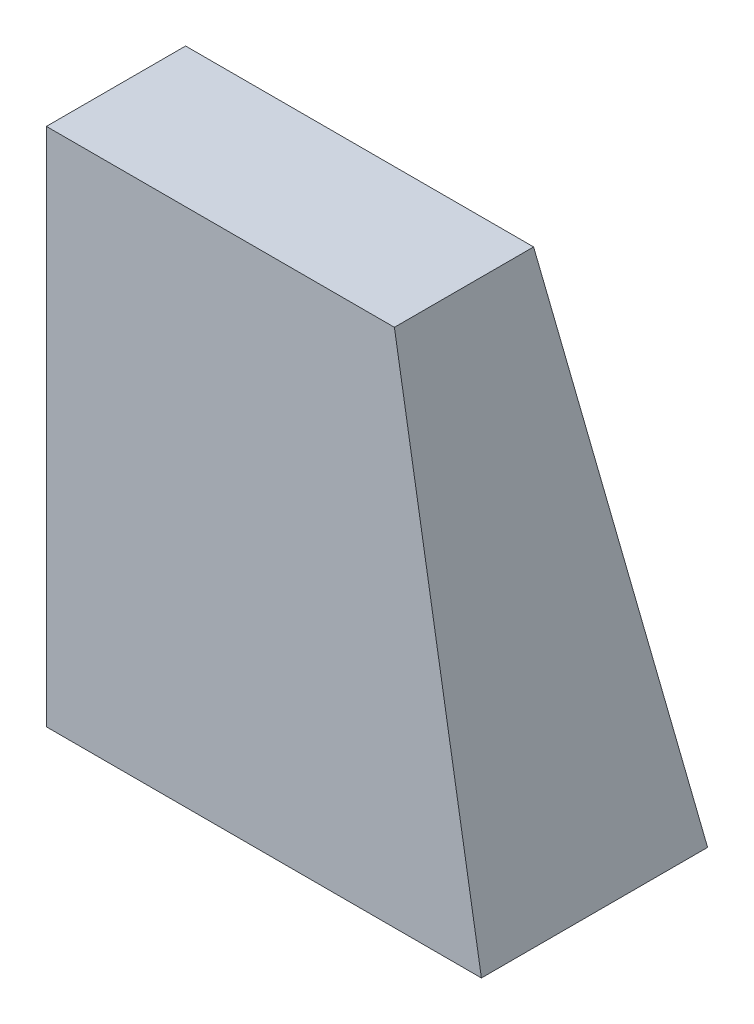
from build123d import *


with BuildPart() as part:
    # Sketch1 → Loft1 section 0
    with BuildSketch(Plane(origin=(0, 0, 0), x_dir=(1, 0, 0), z_dir=(0, 1, 0))):
        with BuildLine():
            Line((0, 0), (127, 0))
            Line((127, 0), (127, 66.04))
            Line((127, 66.04), (0, 66.04))
            Line((0, 66.04), (0, 0))
        make_face()
    # Sketch2 → Loft1 section 1
    with BuildSketch(Plane(origin=(0, 151.819924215, 0), x_dir=(-1, 0, 0), z_dir=(0, 1, 0))):
        with BuildLine():
            Line((0, 0), (-101.6, 0))
            Line((-101.6, 0), (-101.6, -40.64))
            Line((-101.6, -40.64), (0, -40.64))
            Line((0, -40.64), (0, 0))
        make_face()
    loft()


solid = part.part
